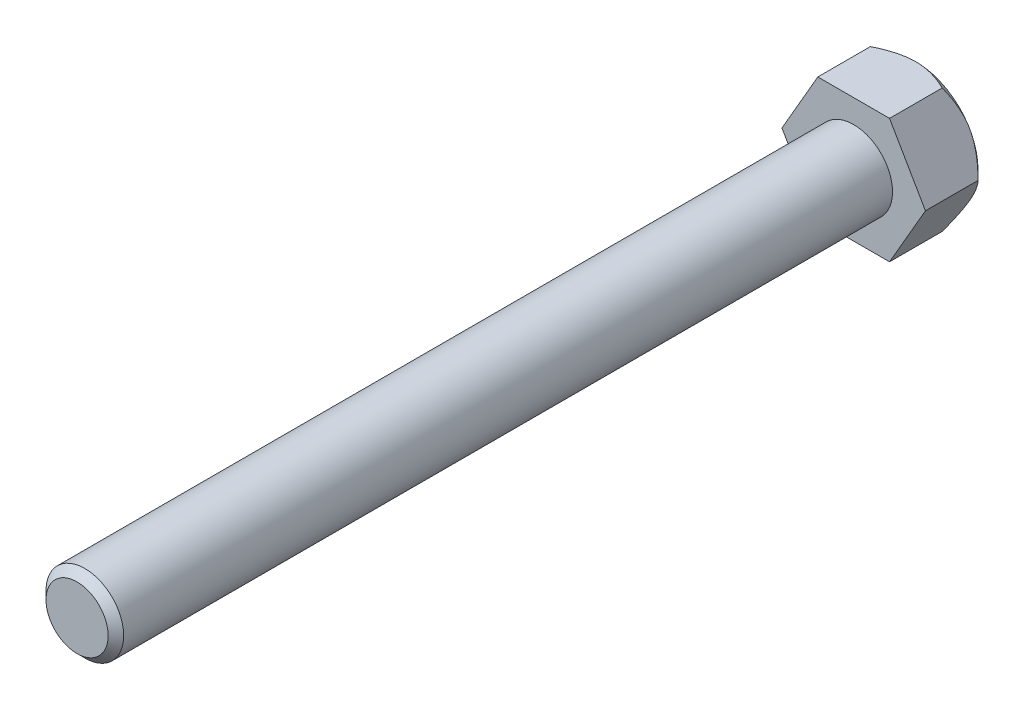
from build123d import *

# Parameters (mm, degrees)
EXTRUSION1_DEPTH = 4
ESQUISSE2_R      = 2.5
EXTRUSION2_DEPTH = 50
CHANFREIN1_SIZE  = 0.5


with BuildPart() as part:
    # Esquisse1 → Extrusion1 (new body)
    with BuildSketch(Plane.XY):
        Polygon((4.618802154, 0), (2.309401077, 4), (-2.309401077, 4), (-4.618802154, 0), (-2.309401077, -4), (2.309401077, -4), align=None)
    extrude(amount=EXTRUSION1_DEPTH)

    # Esquisse2 → Extrusion2 (add)
    with BuildSketch(Plane.XY.offset(4)):
        Circle(ESQUISSE2_R)
    extrude(amount=EXTRUSION2_DEPTH)

    # Esquisse3 → Enl_vement de mati_re-R_volution1 (revolve, cut)
    with BuildSketch(Plane(origin=(0, 0, 0), x_dir=(1, 0, 0), z_dir=(0, 1, 0))):
        Polygon((4.618802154, 0), (4.003417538, 0), (4.618802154, -0.615384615), align=None)
    revolve(axis=Axis((0, 0, 0), (0, 0, 1)), mode=Mode.SUBTRACT)

    # Chanfrein1
    chanfrein1_edges = [part.edges().sort_by_distance(p)[0] for p in [
        (-2.5, 0, 54),
    ]]
    chamfer(chanfrein1_edges, length=CHANFREIN1_SIZE)


solid = part.part
